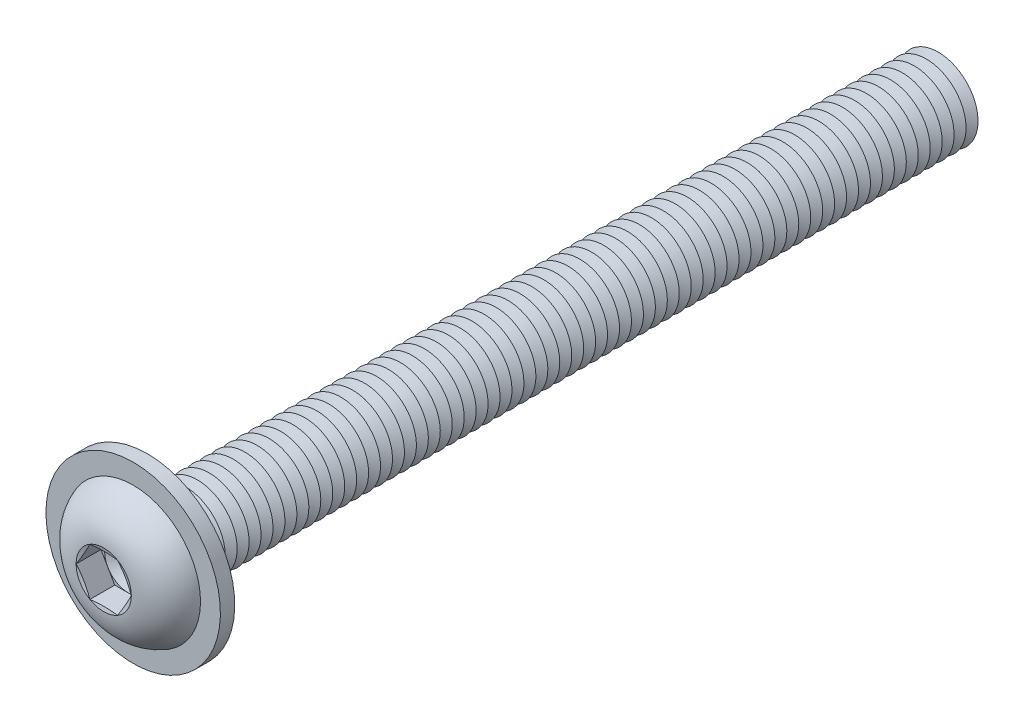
from build123d import *

# Parameters (mm, degrees)
FILLET1_R           = 0.75
LPATTERN1_COUNT     = 66
LPATTERN1_PITCH     = 1.5
CUT_EXTRUDE1_DEPTH  = 3.12
SKETCH5_R           = 10.95
SKETCH5_R_2         = 5.75
BOSS_EXTRUDE1_DEPTH = 1.8


with BuildPart() as part:
    # Sketch1 → Revolve1 (revolve)
    with BuildSketch(Plane(origin=(0, 0, 0), x_dir=(0, 0, -1), z_dir=(1, 0, 0))):
        with BuildLine():
            Line((0, 5), (0, 8.75))
            ThreePointArc((0, 8.75), (-3.814142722, 7.21429474), (-5.5, 3.4641))
            Line((-5.5, 3.4641), (-5.035898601, 1.73205))
            Line((-5.035898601, 1.73205), (-5.5, 1.73205))
            Line((-5.5, 1.73205), (-5.5, 0))
            Line((-5.5, 0), (100, 0))
            Line((100, 0), (100, 5))
            Line((100, 5), (0, 5))
        make_face()
    revolve(axis=Axis((0, 0, -100), (0, 0, 1)))

    # Fillet1
    fillet1_edges = [part.edges().sort_by_distance(p)[0] for p in [
        (0, -5, 0),
    ]]
    fillet(fillet1_edges, radius=FILLET1_R)

    # Sketch2 → Cut-Revolve1 (revolve, cut)
    with BuildSketch(Plane(origin=(0, 0, 0), x_dir=(0, 0, -1), z_dir=(1, 0, 0))):
        Polygon((99.25, 5), (100.75, 5), (100, 3.700961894), align=None)
    cut_revolve1 = revolve(axis=Axis((0, 0, -100), (0, 0, -1)), mode=Mode.SUBTRACT)

    # LPattern1: Cut-Revolve1 ×66
    with Locations(*[(0, 0, i * LPATTERN1_PITCH) for i in range(1, LPATTERN1_COUNT)]):
        add(cut_revolve1, mode=Mode.SUBTRACT)

    # Sketch3 → Cut-Extrude1 (cut)
    with BuildSketch(Plane.XY.offset(5.5)):
        Polygon((1.73205, 2.999998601), (-1.73205, 2.999998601), (-3.4641, 0), (-1.73205, -2.999998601), (1.73205, -2.999998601), (3.4641, 0), align=None)
    extrude(amount=-CUT_EXTRUDE1_DEPTH, mode=Mode.SUBTRACT)

    # Cut-Extrude2 cone 1 section (on through the dimple's axis) → Cut-Extrude2 (revolve, cut)
    with BuildSketch(Plane(origin=(0, 0, 2.38), x_dir=(0, -1, 0), z_dir=(1, 0, 0))):
        Polygon((0, 0), (2.999998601, 0), (0, 1.73205), align=None)
    revolve(axis=Axis((0, 0, 2.38), (0, 0, -1)), mode=Mode.SUBTRACT)

    # Sketch5 → Boss-Extrude1 (add)
    with BuildSketch(Plane(origin=(0, 0, 0), x_dir=(-1, 0, 0), z_dir=(0, 0, -1))):
        with Locations(Location((0, 0, 0), (0, 0, 90))):
            Circle(SKETCH5_R)
        Circle(SKETCH5_R_2, mode=Mode.SUBTRACT)
    extrude(amount=-BOSS_EXTRUDE1_DEPTH)


solid = part.part
